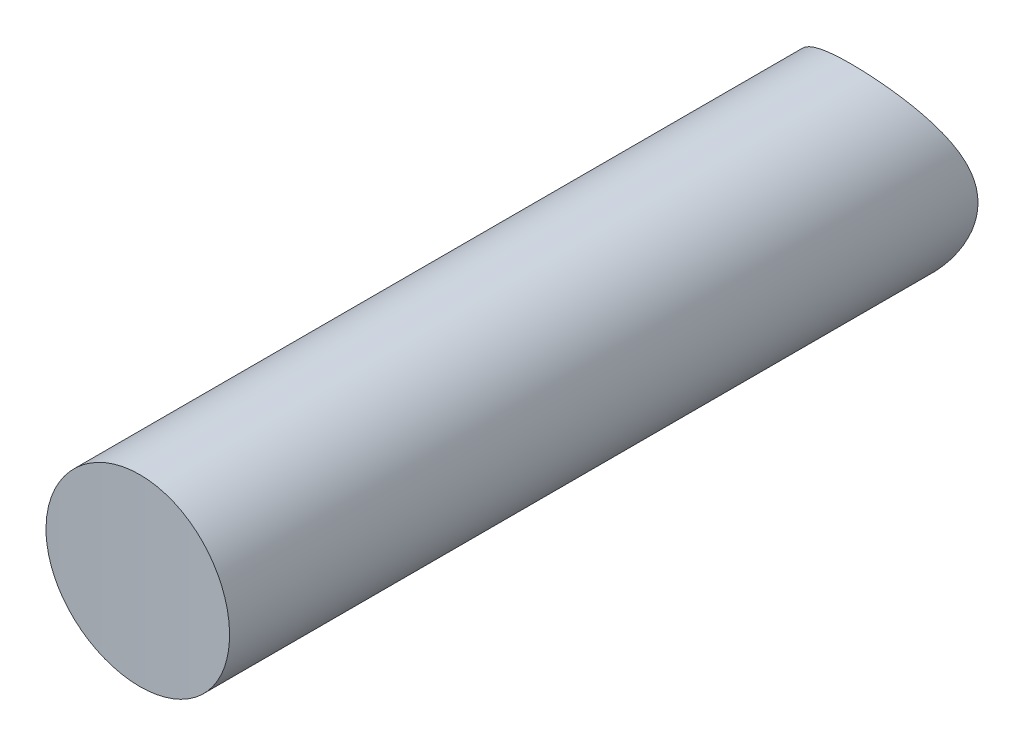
from build123d import *

# Parameters (mm, degrees)
ESQUISSE1_R                  = 4
BOSS_EXTRU_1_DEPTH           = 70
ENL_V_MAT_EXTRU_1_DEPTH      = 71.228199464
ENL_V_MAT_EXTRU_1_DEPTH_BACK = 71.228199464
ESQUISSE2_R                  = 90
ESQUISSE2_R_2                = 6


with BuildPart() as part:
    # Esquisse1 → Boss.-Extru.1 (new body)
    with BuildSketch(Plane.XY):
        Circle(ESQUISSE1_R)
    extrude(amount=BOSS_EXTRU_1_DEPTH)

    # Esquisse2 → Enl_v. mat.-Extru.1 (cut, two sides: drawn at the far end of the back side and taken through both)
    with BuildSketch(Plane(origin=(0, 0, 0), x_dir=(1, 0, 0), z_dir=(0, 1, 0)).offset(-ENL_V_MAT_EXTRU_1_DEPTH_BACK)):
        with Locations((0, -124)):
            Circle(ESQUISSE2_R)
        with Locations((0, 3)):
            Circle(ESQUISSE2_R_2)
    extrude(amount=ENL_V_MAT_EXTRU_1_DEPTH + ENL_V_MAT_EXTRU_1_DEPTH_BACK, mode=Mode.SUBTRACT)


solid = part.part
